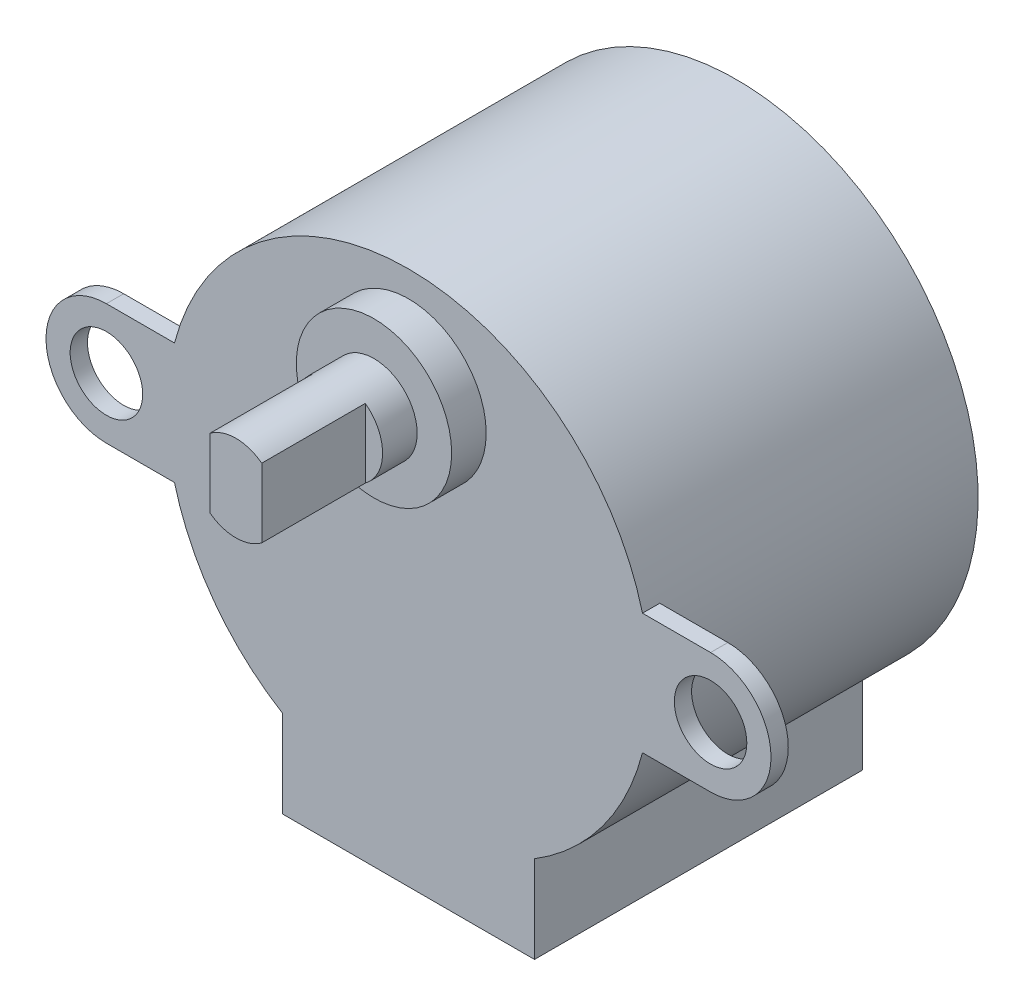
ISO-10303-21;
HEADER;
FILE_DESCRIPTION(('STEP AP214'),'2;1');
FILE_NAME('part.step','',(''),(''),'','','');
FILE_SCHEMA(('AUTOMOTIVE_DESIGN { 1 0 10303 214 1 1 1 1 }'));
ENDSEC;
DATA;
#1=APPLICATION_CONTEXT('core data for automotive mechanical design processes');
#2=APPLICATION_PROTOCOL_DEFINITION('international standard','automotive_design',2000,#1);
#3=PRODUCT_CONTEXT('',#1,'mechanical');
#4=PRODUCT('Part','Part','',(#3));
#5=PRODUCT_RELATED_PRODUCT_CATEGORY('part','',(#4));
#6=PRODUCT_DEFINITION_FORMATION('','',#4);
#7=PRODUCT_DEFINITION_CONTEXT('part definition',#1,'design');
#8=PRODUCT_DEFINITION('design','',#6,#7);
#9=PRODUCT_DEFINITION_SHAPE('','',#8);
#10=(LENGTH_UNIT() NAMED_UNIT(*) SI_UNIT(.MILLI.,.METRE.));
#11=(NAMED_UNIT(*) PLANE_ANGLE_UNIT() SI_UNIT($,.RADIAN.));
#12=(NAMED_UNIT(*) SI_UNIT($,.STERADIAN.) SOLID_ANGLE_UNIT());
#13=UNCERTAINTY_MEASURE_WITH_UNIT(LENGTH_MEASURE(1.E-05),#10,'distance_accuracy_value','');
#14=(GEOMETRIC_REPRESENTATION_CONTEXT(3) GLOBAL_UNCERTAINTY_ASSIGNED_CONTEXT((#13)) GLOBAL_UNIT_ASSIGNED_CONTEXT((#10,
#11,#12)) REPRESENTATION_CONTEXT('',''));
#15=CARTESIAN_POINT('',(0.,0.,0.));
#16=DIRECTION('',(0.,0.,1.));
#17=DIRECTION('',(1.,0.,0.));
#18=AXIS2_PLACEMENT_3D('',#15,#16,#17);
#19=CARTESIAN_POINT('',(0.,8.,5.));
#20=DIRECTION('',(0.,0.,1.));
#21=DIRECTION('',(1.,0.,0.));
#22=AXIS2_PLACEMENT_3D('',#19,#20,#21);
#23=PLANE('',#22);
#24=CARTESIAN_POINT('',(0.,8.,5.));
#25=DIRECTION('',(0.,0.,1.));
#26=DIRECTION('',(1.,0.,0.));
#27=AXIS2_PLACEMENT_3D('',#24,#25,#26);
#28=CIRCLE('',#27,2.5);
#29=CARTESIAN_POINT('',(1.5,6.,5.));
#30=VERTEX_POINT('',#29);
#31=CARTESIAN_POINT('',(1.5,10.,5.));
#32=VERTEX_POINT('',#31);
#33=EDGE_CURVE('E155',#30,#32,#28,.T.);
#34=ORIENTED_EDGE('',*,*,#33,.T.);
#35=DIRECTION('',(0.,-1.,0.));
#36=VECTOR('',#35,1.);
#37=CARTESIAN_POINT('',(1.5,0.,5.));
#38=LINE('',#37,#36);
#39=EDGE_CURVE('E49',#32,#30,#38,.T.);
#40=ORIENTED_EDGE('',*,*,#39,.T.);
#41=EDGE_LOOP('',(#34,#40));
#42=FACE_BOUND('',#41,.T.);
#43=ADVANCED_FACE('F34',(#42),#23,.T.);
#44=CARTESIAN_POINT('',(-17.5,0.,0.));
#45=DIRECTION('',(0.,0.,1.));
#46=DIRECTION('',(1.,0.,0.));
#47=AXIS2_PLACEMENT_3D('',#44,#45,#46);
#48=PLANE('',#47);
#49=CARTESIAN_POINT('',(-17.5,0.,0.));
#50=DIRECTION('',(0.,0.,1.));
#51=DIRECTION('',(1.,0.,0.));
#52=AXIS2_PLACEMENT_3D('',#49,#50,#51);
#53=CIRCLE('',#52,2.1);
#54=CARTESIAN_POINT('',(-15.4,0.,0.));
#55=VERTEX_POINT('',#54);
#56=EDGE_CURVE('E209',#55,#55,#53,.T.);
#57=ORIENTED_EDGE('',*,*,#56,.T.);
#58=EDGE_LOOP('',(#57));
#59=FACE_BOUND('',#58,.T.);
#60=DIRECTION('',(-1.,0.,0.));
#61=VECTOR('',#60,1.);
#62=CARTESIAN_POINT('',(-17.5,3.5,0.));
#63=LINE('',#62,#61);
#64=CARTESIAN_POINT('',(-13.555441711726,3.5,0.));
#65=VERTEX_POINT('',#64);
#66=CARTESIAN_POINT('',(-17.5,3.5,0.));
#67=VERTEX_POINT('',#66);
#68=EDGE_CURVE('E222',#65,#67,#63,.T.);
#69=ORIENTED_EDGE('',*,*,#68,.F.);
#70=CARTESIAN_POINT('',(0.,0.,0.));
#71=DIRECTION('',(0.,0.,1.));
#72=DIRECTION('',(1.,0.,0.));
#73=AXIS2_PLACEMENT_3D('',#70,#71,#72);
#74=CIRCLE('',#73,14.);
#75=CARTESIAN_POINT('',(-13.555441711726,-3.50000000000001,0.));
#76=VERTEX_POINT('',#75);
#77=EDGE_CURVE('E202',#65,#76,#74,.T.);
#78=ORIENTED_EDGE('',*,*,#77,.T.);
#79=DIRECTION('',(1.,0.,0.));
#80=VECTOR('',#79,1.);
#81=CARTESIAN_POINT('',(-17.5,-3.5,0.));
#82=LINE('',#81,#80);
#83=CARTESIAN_POINT('',(-17.5,-3.5,0.));
#84=VERTEX_POINT('',#83);
#85=EDGE_CURVE('E247',#84,#76,#82,.T.);
#86=ORIENTED_EDGE('',*,*,#85,.F.);
#87=CARTESIAN_POINT('',(-17.5,0.,0.));
#88=DIRECTION('',(0.,0.,1.));
#89=DIRECTION('',(1.,0.,0.));
#90=AXIS2_PLACEMENT_3D('',#87,#88,#89);
#91=CIRCLE('',#90,3.5);
#92=EDGE_CURVE('E215',#67,#84,#91,.T.);
#93=ORIENTED_EDGE('',*,*,#92,.F.);
#94=EDGE_LOOP('',(#69,#78,#86,#93));
#95=FACE_BOUND('',#94,.T.);
#96=ADVANCED_FACE('F297',(#59,#95),#48,.F.);
#97=CARTESIAN_POINT('',(-17.5,0.,1.));
#98=DIRECTION('',(0.,0.,1.));
#99=DIRECTION('',(1.,0.,0.));
#100=AXIS2_PLACEMENT_3D('',#97,#98,#99);
#101=PLANE('',#100);
#102=CARTESIAN_POINT('',(0.,8.,1.));
#103=DIRECTION('',(0.,0.,1.));
#104=DIRECTION('',(1.,0.,0.));
#105=AXIS2_PLACEMENT_3D('',#102,#103,#104);
#106=CIRCLE('',#105,4.5);
#107=CARTESIAN_POINT('',(4.5,8.,1.));
#108=VERTEX_POINT('',#107);
#109=EDGE_CURVE('E188',#108,#108,#106,.T.);
#110=ORIENTED_EDGE('',*,*,#109,.F.);
#111=EDGE_LOOP('',(#110));
#112=FACE_BOUND('',#111,.T.);
#113=DIRECTION('',(-1.,0.,0.));
#114=VECTOR('',#113,1.);
#115=CARTESIAN_POINT('',(17.5,3.5,1.));
#116=LINE('',#115,#114);
#117=CARTESIAN_POINT('',(17.5,3.5,1.));
#118=VERTEX_POINT('',#117);
#119=CARTESIAN_POINT('',(13.555441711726,3.5,1.));
#120=VERTEX_POINT('',#119);
#121=EDGE_CURVE('E238',#118,#120,#116,.T.);
#122=ORIENTED_EDGE('',*,*,#121,.T.);
#123=CARTESIAN_POINT('',(0.,0.,1.));
#124=DIRECTION('',(0.,0.,1.));
#125=DIRECTION('',(-1.,0.,0.));
#126=AXIS2_PLACEMENT_3D('',#123,#124,#125);
#127=CIRCLE('',#126,14.);
#128=CARTESIAN_POINT('',(-13.555441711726,3.5,1.));
#129=VERTEX_POINT('',#128);
#130=EDGE_CURVE('E240',#120,#129,#127,.T.);
#131=ORIENTED_EDGE('',*,*,#130,.T.);
#132=DIRECTION('',(-1.,0.,0.));
#133=VECTOR('',#132,1.);
#134=CARTESIAN_POINT('',(-17.5,3.5,1.));
#135=LINE('',#134,#133);
#136=CARTESIAN_POINT('',(-17.5,3.5,1.));
#137=VERTEX_POINT('',#136);
#138=EDGE_CURVE('E242',#129,#137,#135,.T.);
#139=ORIENTED_EDGE('',*,*,#138,.T.);
#140=CARTESIAN_POINT('',(-17.5,0.,1.));
#141=DIRECTION('',(0.,0.,1.));
#142=DIRECTION('',(1.,0.,0.));
#143=AXIS2_PLACEMENT_3D('',#140,#141,#142);
#144=CIRCLE('',#143,3.5);
#145=CARTESIAN_POINT('',(-17.5,-3.5,1.));
#146=VERTEX_POINT('',#145);
#147=EDGE_CURVE('E218',#137,#146,#144,.T.);
#148=ORIENTED_EDGE('',*,*,#147,.T.);
#149=DIRECTION('',(1.,0.,0.));
#150=VECTOR('',#149,1.);
#151=CARTESIAN_POINT('',(-17.5,-3.5,1.));
#152=LINE('',#151,#150);
#153=CARTESIAN_POINT('',(-13.555441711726,-3.50000000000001,1.));
#154=VERTEX_POINT('',#153);
#155=EDGE_CURVE('E221',#146,#154,#152,.T.);
#156=ORIENTED_EDGE('',*,*,#155,.T.);
#157=CARTESIAN_POINT('',(0.,0.,1.));
#158=DIRECTION('',(0.,0.,1.));
#159=DIRECTION('',(-1.,0.,0.));
#160=AXIS2_PLACEMENT_3D('',#157,#158,#159);
#161=CIRCLE('',#160,14.);
#162=CARTESIAN_POINT('',(-7.3,-11.9461290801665,1.));
#163=VERTEX_POINT('',#162);
#164=EDGE_CURVE('E224',#154,#163,#161,.T.);
#165=ORIENTED_EDGE('',*,*,#164,.T.);
#166=DIRECTION('',(0.,-1.,0.));
#167=VECTOR('',#166,1.);
#168=CARTESIAN_POINT('',(-7.3,-17.,1.));
#169=LINE('',#168,#167);
#170=CARTESIAN_POINT('',(-7.3,-17.,1.));
#171=VERTEX_POINT('',#170);
#172=EDGE_CURVE('E226',#163,#171,#169,.T.);
#173=ORIENTED_EDGE('',*,*,#172,.T.);
#174=DIRECTION('',(1.,0.,0.));
#175=VECTOR('',#174,1.);
#176=CARTESIAN_POINT('',(-7.3,-17.,1.));
#177=LINE('',#176,#175);
#178=CARTESIAN_POINT('',(7.3,-17.,1.));
#179=VERTEX_POINT('',#178);
#180=EDGE_CURVE('E228',#171,#179,#177,.T.);
#181=ORIENTED_EDGE('',*,*,#180,.T.);
#182=DIRECTION('',(0.,1.,0.));
#183=VECTOR('',#182,1.);
#184=CARTESIAN_POINT('',(7.3,-17.,1.));
#185=LINE('',#184,#183);
#186=CARTESIAN_POINT('',(7.3,-11.9461290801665,1.));
#187=VERTEX_POINT('',#186);
#188=EDGE_CURVE('E230',#179,#187,#185,.T.);
#189=ORIENTED_EDGE('',*,*,#188,.T.);
#190=CARTESIAN_POINT('',(0.,0.,1.));
#191=DIRECTION('',(0.,0.,1.));
#192=DIRECTION('',(-1.,0.,0.));
#193=AXIS2_PLACEMENT_3D('',#190,#191,#192);
#194=CIRCLE('',#193,14.);
#195=CARTESIAN_POINT('',(13.555441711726,-3.5,1.));
#196=VERTEX_POINT('',#195);
#197=EDGE_CURVE('E232',#187,#196,#194,.T.);
#198=ORIENTED_EDGE('',*,*,#197,.T.);
#199=DIRECTION('',(1.,0.,0.));
#200=VECTOR('',#199,1.);
#201=CARTESIAN_POINT('',(13.555441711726,-3.5,1.));
#202=LINE('',#201,#200);
#203=CARTESIAN_POINT('',(17.5,-3.5,1.));
#204=VERTEX_POINT('',#203);
#205=EDGE_CURVE('E234',#196,#204,#202,.T.);
#206=ORIENTED_EDGE('',*,*,#205,.T.);
#207=CARTESIAN_POINT('',(17.5,0.,1.));
#208=DIRECTION('',(0.,0.,1.));
#209=DIRECTION('',(-1.,0.,0.));
#210=AXIS2_PLACEMENT_3D('',#207,#208,#209);
#211=CIRCLE('',#210,3.5);
#212=EDGE_CURVE('E236',#204,#118,#211,.T.);
#213=ORIENTED_EDGE('',*,*,#212,.T.);
#214=EDGE_LOOP('',(#122,#131,#139,#148,#156,#165,#173,#181,#189,#198,#206,#213));
#215=FACE_BOUND('',#214,.T.);
#216=CARTESIAN_POINT('',(17.5,0.,1.));
#217=DIRECTION('',(0.,0.,1.));
#218=DIRECTION('',(1.,0.,0.));
#219=AXIS2_PLACEMENT_3D('',#216,#217,#218);
#220=CIRCLE('',#219,2.1);
#221=CARTESIAN_POINT('',(19.6,0.,1.));
#222=VERTEX_POINT('',#221);
#223=EDGE_CURVE('E212',#222,#222,#220,.T.);
#224=ORIENTED_EDGE('',*,*,#223,.F.);
#225=EDGE_LOOP('',(#224));
#226=FACE_BOUND('',#225,.T.);
#227=CARTESIAN_POINT('',(-17.5,0.,1.));
#228=DIRECTION('',(0.,0.,1.));
#229=DIRECTION('',(1.,0.,0.));
#230=AXIS2_PLACEMENT_3D('',#227,#228,#229);
#231=CIRCLE('',#230,2.1);
#232=CARTESIAN_POINT('',(-15.4,0.,1.));
#233=VERTEX_POINT('',#232);
#234=EDGE_CURVE('E205',#233,#233,#231,.T.);
#235=ORIENTED_EDGE('',*,*,#234,.F.);
#236=EDGE_LOOP('',(#235));
#237=FACE_BOUND('',#236,.T.);
#238=ADVANCED_FACE('F305',(#112,#215,#226,#237),#101,.T.);
#239=DIRECTION('',(1.,0.,0.));
#240=VECTOR('',#239,1.);
#241=CARTESIAN_POINT('',(13.555441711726,-3.5,0.));
#242=LINE('',#241,#240);
#243=CARTESIAN_POINT('',(13.555441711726,-3.5,0.));
#244=VERTEX_POINT('',#243);
#245=CARTESIAN_POINT('',(17.5,-3.5,0.));
#246=VERTEX_POINT('',#245);
#247=EDGE_CURVE('E250',#244,#246,#242,.T.);
#248=ORIENTED_EDGE('',*,*,#247,.F.);
#249=CARTESIAN_POINT('',(13.555441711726,3.5,0.));
#250=VERTEX_POINT('',#249);
#251=EDGE_CURVE('E204',#244,#250,#74,.T.);
#252=ORIENTED_EDGE('',*,*,#251,.T.);
#253=DIRECTION('',(-1.,0.,0.));
#254=VECTOR('',#253,1.);
#255=CARTESIAN_POINT('',(17.5,3.5,0.));
#256=LINE('',#255,#254);
#257=CARTESIAN_POINT('',(17.5,3.5,0.));
#258=VERTEX_POINT('',#257);
#259=EDGE_CURVE('E254',#258,#250,#256,.T.);
#260=ORIENTED_EDGE('',*,*,#259,.F.);
#261=CARTESIAN_POINT('',(17.5,0.,0.));
#262=DIRECTION('',(0.,0.,1.));
#263=DIRECTION('',(-1.,0.,0.));
#264=AXIS2_PLACEMENT_3D('',#261,#262,#263);
#265=CIRCLE('',#264,3.5);
#266=EDGE_CURVE('E252',#246,#258,#265,.T.);
#267=ORIENTED_EDGE('',*,*,#266,.F.);
#268=EDGE_LOOP('',(#248,#252,#260,#267));
#269=FACE_BOUND('',#268,.T.);
#270=CARTESIAN_POINT('',(17.5,0.,0.));
#271=DIRECTION('',(0.,0.,1.));
#272=DIRECTION('',(1.,0.,0.));
#273=AXIS2_PLACEMENT_3D('',#270,#271,#272);
#274=CIRCLE('',#273,2.1);
#275=CARTESIAN_POINT('',(19.6,0.,0.));
#276=VERTEX_POINT('',#275);
#277=EDGE_CURVE('E208',#276,#276,#274,.T.);
#278=ORIENTED_EDGE('',*,*,#277,.T.);
#279=EDGE_LOOP('',(#278));
#280=FACE_BOUND('',#279,.T.);
#281=ADVANCED_FACE('F317',(#269,#280),#48,.F.);
#282=CARTESIAN_POINT('',(-17.5,0.,1.));
#283=DIRECTION('',(0.,0.,-1.));
#284=DIRECTION('',(-1.,0.,0.));
#285=AXIS2_PLACEMENT_3D('',#282,#283,#284);
#286=CYLINDRICAL_SURFACE('',#285,3.5);
#287=ORIENTED_EDGE('',*,*,#92,.T.);
#288=DIRECTION('',(0.,0.,-1.));
#289=VECTOR('',#288,1.);
#290=CARTESIAN_POINT('',(-17.5,-3.5,1.));
#291=LINE('',#290,#289);
#292=EDGE_CURVE('E38',#146,#84,#291,.T.);
#293=ORIENTED_EDGE('',*,*,#292,.F.);
#294=ORIENTED_EDGE('',*,*,#147,.F.);
#295=DIRECTION('',(0.,0.,-1.));
#296=VECTOR('',#295,1.);
#297=CARTESIAN_POINT('',(-17.5,3.5,1.));
#298=LINE('',#297,#296);
#299=EDGE_CURVE('E244',#137,#67,#298,.T.);
#300=ORIENTED_EDGE('',*,*,#299,.T.);
#301=EDGE_LOOP('',(#287,#293,#294,#300));
#302=FACE_BOUND('',#301,.T.);
#303=ADVANCED_FACE('F36',(#302),#286,.T.);
#304=CARTESIAN_POINT('',(-17.5,-3.5,1.));
#305=DIRECTION('',(0.,1.,0.));
#306=DIRECTION('',(0.,0.,1.));
#307=AXIS2_PLACEMENT_3D('',#304,#305,#306);
#308=PLANE('',#307);
#309=ORIENTED_EDGE('',*,*,#85,.T.);
#310=DIRECTION('',(0.,0.,-1.));
#311=VECTOR('',#310,1.);
#312=CARTESIAN_POINT('',(-13.555441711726,-3.50000000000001,1.));
#313=LINE('',#312,#311);
#314=EDGE_CURVE('E282',#154,#76,#313,.T.);
#315=ORIENTED_EDGE('',*,*,#314,.F.);
#316=ORIENTED_EDGE('',*,*,#155,.F.);
#317=ORIENTED_EDGE('',*,*,#292,.T.);
#318=EDGE_LOOP('',(#309,#315,#316,#317));
#319=FACE_BOUND('',#318,.T.);
#320=ADVANCED_FACE('F290',(#319),#308,.F.);
#321=CARTESIAN_POINT('',(-7.3,-17.,1.));
#322=DIRECTION('',(1.,0.,0.));
#323=DIRECTION('',(0.,1.,0.));
#324=AXIS2_PLACEMENT_3D('',#321,#322,#323);
#325=PLANE('',#324);
#326=DIRECTION('',(0.,0.,-1.));
#327=VECTOR('',#326,1.);
#328=CARTESIAN_POINT('',(-7.3,-11.9461290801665,1.));
#329=LINE('',#328,#327);
#330=CARTESIAN_POINT('',(-7.3,-11.9461290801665,-18.));
#331=VERTEX_POINT('',#330);
#332=EDGE_CURVE('E281',#163,#331,#329,.T.);
#333=ORIENTED_EDGE('',*,*,#332,.T.);
#334=DIRECTION('',(0.,-1.,0.));
#335=VECTOR('',#334,1.);
#336=CARTESIAN_POINT('',(-7.3,-11.9461290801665,-18.));
#337=LINE('',#336,#335);
#338=CARTESIAN_POINT('',(-7.3,-17.,-18.));
#339=VERTEX_POINT('',#338);
#340=EDGE_CURVE('E193',#331,#339,#337,.T.);
#341=ORIENTED_EDGE('',*,*,#340,.T.);
#342=DIRECTION('',(0.,0.,-1.));
#343=VECTOR('',#342,1.);
#344=CARTESIAN_POINT('',(-7.3,-17.,1.));
#345=LINE('',#344,#343);
#346=EDGE_CURVE('E279',#171,#339,#345,.T.);
#347=ORIENTED_EDGE('',*,*,#346,.F.);
#348=ORIENTED_EDGE('',*,*,#172,.F.);
#349=EDGE_LOOP('',(#333,#341,#347,#348));
#350=FACE_BOUND('',#349,.T.);
#351=ADVANCED_FACE('F344',(#350),#325,.F.);
#352=CARTESIAN_POINT('',(-7.3,-17.,1.));
#353=DIRECTION('',(0.,1.,0.));
#354=DIRECTION('',(-1.,0.,0.));
#355=AXIS2_PLACEMENT_3D('',#352,#353,#354);
#356=PLANE('',#355);
#357=ORIENTED_EDGE('',*,*,#346,.T.);
#358=DIRECTION('',(1.,0.,0.));
#359=VECTOR('',#358,1.);
#360=CARTESIAN_POINT('',(-7.3,-17.,-18.));
#361=LINE('',#360,#359);
#362=CARTESIAN_POINT('',(7.3,-17.,-18.));
#363=VERTEX_POINT('',#362);
#364=EDGE_CURVE('E196',#339,#363,#361,.T.);
#365=ORIENTED_EDGE('',*,*,#364,.T.);
#366=DIRECTION('',(0.,0.,-1.));
#367=VECTOR('',#366,1.);
#368=CARTESIAN_POINT('',(7.3,-17.,1.));
#369=LINE('',#368,#367);
#370=EDGE_CURVE('E277',#179,#363,#369,.T.);
#371=ORIENTED_EDGE('',*,*,#370,.F.);
#372=ORIENTED_EDGE('',*,*,#180,.F.);
#373=EDGE_LOOP('',(#357,#365,#371,#372));
#374=FACE_BOUND('',#373,.T.);
#375=ADVANCED_FACE('F341',(#374),#356,.F.);
#376=CARTESIAN_POINT('',(7.3,-17.,1.));
#377=DIRECTION('',(-1.,0.,0.));
#378=DIRECTION('',(0.,0.,1.));
#379=AXIS2_PLACEMENT_3D('',#376,#377,#378);
#380=PLANE('',#379);
#381=ORIENTED_EDGE('',*,*,#370,.T.);
#382=DIRECTION('',(0.,1.,0.));
#383=VECTOR('',#382,1.);
#384=CARTESIAN_POINT('',(7.3,-17.,-18.));
#385=LINE('',#384,#383);
#386=CARTESIAN_POINT('',(7.3,-11.9461290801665,-18.));
#387=VERTEX_POINT('',#386);
#388=EDGE_CURVE('E199',#363,#387,#385,.T.);
#389=ORIENTED_EDGE('',*,*,#388,.T.);
#390=DIRECTION('',(0.,0.,-1.));
#391=VECTOR('',#390,1.);
#392=CARTESIAN_POINT('',(7.3,-11.9461290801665,1.));
#393=LINE('',#392,#391);
#394=EDGE_CURVE('E275',#187,#387,#393,.T.);
#395=ORIENTED_EDGE('',*,*,#394,.F.);
#396=ORIENTED_EDGE('',*,*,#188,.F.);
#397=EDGE_LOOP('',(#381,#389,#395,#396));
#398=FACE_BOUND('',#397,.T.);
#399=ADVANCED_FACE('F337',(#398),#380,.F.);
#400=CARTESIAN_POINT('',(13.555441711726,-3.5,1.));
#401=DIRECTION('',(0.,1.,0.));
#402=DIRECTION('',(0.,0.,1.));
#403=AXIS2_PLACEMENT_3D('',#400,#401,#402);
#404=PLANE('',#403);
#405=ORIENTED_EDGE('',*,*,#247,.T.);
#406=DIRECTION('',(0.,0.,-1.));
#407=VECTOR('',#406,1.);
#408=CARTESIAN_POINT('',(17.5,-3.5,1.));
#409=LINE('',#408,#407);
#410=EDGE_CURVE('E269',#204,#246,#409,.T.);
#411=ORIENTED_EDGE('',*,*,#410,.F.);
#412=ORIENTED_EDGE('',*,*,#205,.F.);
#413=DIRECTION('',(0.,0.,-1.));
#414=VECTOR('',#413,1.);
#415=CARTESIAN_POINT('',(13.555441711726,-3.5,1.));
#416=LINE('',#415,#414);
#417=EDGE_CURVE('E272',#196,#244,#416,.T.);
#418=ORIENTED_EDGE('',*,*,#417,.T.);
#419=EDGE_LOOP('',(#405,#411,#412,#418));
#420=FACE_BOUND('',#419,.T.);
#421=ADVANCED_FACE('F321',(#420),#404,.F.);
#422=CARTESIAN_POINT('',(17.5,0.,1.));
#423=DIRECTION('',(0.,0.,-1.));
#424=DIRECTION('',(-1.,0.,0.));
#425=AXIS2_PLACEMENT_3D('',#422,#423,#424);
#426=CYLINDRICAL_SURFACE('',#425,3.5);
#427=ORIENTED_EDGE('',*,*,#266,.T.);
#428=DIRECTION('',(0.,0.,-1.));
#429=VECTOR('',#428,1.);
#430=CARTESIAN_POINT('',(17.5,3.5,1.));
#431=LINE('',#430,#429);
#432=EDGE_CURVE('E266',#118,#258,#431,.T.);
#433=ORIENTED_EDGE('',*,*,#432,.F.);
#434=ORIENTED_EDGE('',*,*,#212,.F.);
#435=ORIENTED_EDGE('',*,*,#410,.T.);
#436=EDGE_LOOP('',(#427,#433,#434,#435));
#437=FACE_BOUND('',#436,.T.);
#438=ADVANCED_FACE('F325',(#437),#426,.T.);
#439=CARTESIAN_POINT('',(17.5,3.5,1.));
#440=DIRECTION('',(0.,-1.,0.));
#441=DIRECTION('',(0.,0.,-1.));
#442=AXIS2_PLACEMENT_3D('',#439,#440,#441);
#443=PLANE('',#442);
#444=ORIENTED_EDGE('',*,*,#259,.T.);
#445=DIRECTION('',(0.,0.,-1.));
#446=VECTOR('',#445,1.);
#447=CARTESIAN_POINT('',(13.555441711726,3.5,1.));
#448=LINE('',#447,#446);
#449=EDGE_CURVE('E263',#120,#250,#448,.T.);
#450=ORIENTED_EDGE('',*,*,#449,.F.);
#451=ORIENTED_EDGE('',*,*,#121,.F.);
#452=ORIENTED_EDGE('',*,*,#432,.T.);
#453=EDGE_LOOP('',(#444,#450,#451,#452));
#454=FACE_BOUND('',#453,.T.);
#455=ADVANCED_FACE('F311',(#454),#443,.F.);
#456=CARTESIAN_POINT('',(0.,0.,1.));
#457=DIRECTION('',(0.,0.,-1.));
#458=DIRECTION('',(-1.,0.,0.));
#459=AXIS2_PLACEMENT_3D('',#456,#457,#458);
#460=CYLINDRICAL_SURFACE('',#459,14.);
#461=ORIENTED_EDGE('',*,*,#449,.T.);
#462=ORIENTED_EDGE('',*,*,#251,.F.);
#463=ORIENTED_EDGE('',*,*,#417,.F.);
#464=ORIENTED_EDGE('',*,*,#197,.F.);
#465=ORIENTED_EDGE('',*,*,#394,.T.);
#466=CARTESIAN_POINT('',(0.,0.,-18.));
#467=DIRECTION('',(0.,0.,1.));
#468=DIRECTION('',(1.,0.,0.));
#469=AXIS2_PLACEMENT_3D('',#466,#467,#468);
#470=CIRCLE('',#469,14.);
#471=EDGE_CURVE('E187',#387,#331,#470,.T.);
#472=ORIENTED_EDGE('',*,*,#471,.T.);
#473=ORIENTED_EDGE('',*,*,#332,.F.);
#474=ORIENTED_EDGE('',*,*,#164,.F.);
#475=ORIENTED_EDGE('',*,*,#314,.T.);
#476=ORIENTED_EDGE('',*,*,#77,.F.);
#477=DIRECTION('',(0.,0.,-1.));
#478=VECTOR('',#477,1.);
#479=CARTESIAN_POINT('',(-13.555441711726,3.5,1.));
#480=LINE('',#479,#478);
#481=EDGE_CURVE('E260',#129,#65,#480,.T.);
#482=ORIENTED_EDGE('',*,*,#481,.F.);
#483=ORIENTED_EDGE('',*,*,#130,.F.);
#484=EDGE_LOOP('',(#461,#462,#463,#464,#465,#472,#473,#474,#475,#476,#482,#483));
#485=FACE_BOUND('',#484,.T.);
#486=ADVANCED_FACE('F299',(#485),#460,.T.);
#487=CARTESIAN_POINT('',(-17.5,3.5,1.));
#488=DIRECTION('',(0.,-1.,0.));
#489=DIRECTION('',(0.,0.,-1.));
#490=AXIS2_PLACEMENT_3D('',#487,#488,#489);
#491=PLANE('',#490);
#492=ORIENTED_EDGE('',*,*,#68,.T.);
#493=ORIENTED_EDGE('',*,*,#299,.F.);
#494=ORIENTED_EDGE('',*,*,#138,.F.);
#495=ORIENTED_EDGE('',*,*,#481,.T.);
#496=EDGE_LOOP('',(#492,#493,#494,#495));
#497=FACE_BOUND('',#496,.T.);
#498=ADVANCED_FACE('F303',(#497),#491,.F.);
#499=CARTESIAN_POINT('',(17.5,0.,1.));
#500=DIRECTION('',(0.,0.,-1.));
#501=DIRECTION('',(-1.,0.,0.));
#502=AXIS2_PLACEMENT_3D('',#499,#500,#501);
#503=CYLINDRICAL_SURFACE('',#502,2.1);
#504=ORIENTED_EDGE('',*,*,#223,.T.);
#505=EDGE_LOOP('',(#504));
#506=FACE_BOUND('',#505,.T.);
#507=ORIENTED_EDGE('',*,*,#277,.F.);
#508=EDGE_LOOP('',(#507));
#509=FACE_BOUND('',#508,.T.);
#510=ADVANCED_FACE('F385',(#506,#509),#503,.F.);
#511=CARTESIAN_POINT('',(-17.5,0.,1.));
#512=DIRECTION('',(0.,0.,-1.));
#513=DIRECTION('',(-1.,0.,0.));
#514=AXIS2_PLACEMENT_3D('',#511,#512,#513);
#515=CYLINDRICAL_SURFACE('',#514,2.1);
#516=ORIENTED_EDGE('',*,*,#234,.T.);
#517=EDGE_LOOP('',(#516));
#518=FACE_BOUND('',#517,.T.);
#519=ORIENTED_EDGE('',*,*,#56,.F.);
#520=EDGE_LOOP('',(#519));
#521=FACE_BOUND('',#520,.T.);
#522=ADVANCED_FACE('F382',(#518,#521),#515,.F.);
#523=CARTESIAN_POINT('',(0.,0.,-18.));
#524=DIRECTION('',(0.,0.,1.));
#525=DIRECTION('',(1.,0.,0.));
#526=AXIS2_PLACEMENT_3D('',#523,#524,#525);
#527=PLANE('',#526);
#528=ORIENTED_EDGE('',*,*,#471,.F.);
#529=ORIENTED_EDGE('',*,*,#388,.F.);
#530=ORIENTED_EDGE('',*,*,#364,.F.);
#531=ORIENTED_EDGE('',*,*,#340,.F.);
#532=EDGE_LOOP('',(#528,#529,#530,#531));
#533=FACE_BOUND('',#532,.T.);
#534=ADVANCED_FACE('F335',(#533),#527,.F.);
#535=CARTESIAN_POINT('',(0.,8.,3.));
#536=DIRECTION('',(0.,0.,-1.));
#537=DIRECTION('',(-1.,0.,0.));
#538=AXIS2_PLACEMENT_3D('',#535,#536,#537);
#539=CYLINDRICAL_SURFACE('',#538,4.5);
#540=CARTESIAN_POINT('',(0.,8.,3.));
#541=DIRECTION('',(0.,0.,1.));
#542=DIRECTION('',(1.,0.,0.));
#543=AXIS2_PLACEMENT_3D('',#540,#541,#542);
#544=CIRCLE('',#543,4.5);
#545=CARTESIAN_POINT('',(4.5,8.,3.));
#546=VERTEX_POINT('',#545);
#547=EDGE_CURVE('E184',#546,#546,#544,.T.);
#548=ORIENTED_EDGE('',*,*,#547,.F.);
#549=EDGE_LOOP('',(#548));
#550=FACE_BOUND('',#549,.T.);
#551=ORIENTED_EDGE('',*,*,#109,.T.);
#552=EDGE_LOOP('',(#551));
#553=FACE_BOUND('',#552,.T.);
#554=ADVANCED_FACE('F373',(#550,#553),#539,.T.);
#555=CARTESIAN_POINT('',(0.,8.,3.));
#556=DIRECTION('',(0.,0.,1.));
#557=DIRECTION('',(1.,0.,0.));
#558=AXIS2_PLACEMENT_3D('',#555,#556,#557);
#559=PLANE('',#558);
#560=CARTESIAN_POINT('',(0.,8.,3.));
#561=DIRECTION('',(0.,0.,1.));
#562=DIRECTION('',(1.,0.,0.));
#563=AXIS2_PLACEMENT_3D('',#560,#561,#562);
#564=CIRCLE('',#563,2.5);
#565=CARTESIAN_POINT('',(2.5,8.,3.));
#566=VERTEX_POINT('',#565);
#567=EDGE_CURVE('E11',#566,#566,#564,.T.);
#568=ORIENTED_EDGE('',*,*,#567,.F.);
#569=EDGE_LOOP('',(#568));
#570=FACE_BOUND('',#569,.T.);
#571=ORIENTED_EDGE('',*,*,#547,.T.);
#572=EDGE_LOOP('',(#571));
#573=FACE_BOUND('',#572,.T.);
#574=ADVANCED_FACE('F369',(#570,#573),#559,.T.);
#575=CARTESIAN_POINT('',(0.,8.,5.));
#576=DIRECTION('',(0.,0.,-1.));
#577=DIRECTION('',(-1.,0.,0.));
#578=AXIS2_PLACEMENT_3D('',#575,#576,#577);
#579=CYLINDRICAL_SURFACE('',#578,2.5);
#580=CARTESIAN_POINT('',(-1.5,10.,5.));
#581=VERTEX_POINT('',#580);
#582=CARTESIAN_POINT('',(-1.5,6.,5.));
#583=VERTEX_POINT('',#582);
#584=EDGE_CURVE('E182',#581,#583,#28,.T.);
#585=ORIENTED_EDGE('',*,*,#584,.F.);
#586=DIRECTION('',(0.,0.,-1.));
#587=VECTOR('',#586,1.);
#588=CARTESIAN_POINT('',(-1.5,10.,11.));
#589=LINE('',#588,#587);
#590=CARTESIAN_POINT('',(-1.5,10.,11.));
#591=VERTEX_POINT('',#590);
#592=EDGE_CURVE('E156',#591,#581,#589,.T.);
#593=ORIENTED_EDGE('',*,*,#592,.F.);
#594=CARTESIAN_POINT('',(0.,8.,11.));
#595=DIRECTION('',(0.,0.,1.));
#596=DIRECTION('',(1.,0.,0.));
#597=AXIS2_PLACEMENT_3D('',#594,#595,#596);
#598=CIRCLE('',#597,2.5);
#599=CARTESIAN_POINT('',(1.5,10.,11.));
#600=VERTEX_POINT('',#599);
#601=EDGE_CURVE('E159',#600,#591,#598,.T.);
#602=ORIENTED_EDGE('',*,*,#601,.F.);
#603=DIRECTION('',(0.,0.,-1.));
#604=VECTOR('',#603,1.);
#605=CARTESIAN_POINT('',(1.5,10.,11.));
#606=LINE('',#605,#604);
#607=EDGE_CURVE('E148',#600,#32,#606,.T.);
#608=ORIENTED_EDGE('',*,*,#607,.T.);
#609=ORIENTED_EDGE('',*,*,#33,.F.);
#610=DIRECTION('',(0.,0.,-1.));
#611=VECTOR('',#610,1.);
#612=CARTESIAN_POINT('',(1.5,6.,11.));
#613=LINE('',#612,#611);
#614=CARTESIAN_POINT('',(1.5,6.,11.));
#615=VERTEX_POINT('',#614);
#616=EDGE_CURVE('E176',#615,#30,#613,.T.);
#617=ORIENTED_EDGE('',*,*,#616,.F.);
#618=CARTESIAN_POINT('',(-1.5,6.,11.));
#619=VERTEX_POINT('',#618);
#620=EDGE_CURVE('E167',#619,#615,#598,.T.);
#621=ORIENTED_EDGE('',*,*,#620,.F.);
#622=DIRECTION('',(0.,0.,-1.));
#623=VECTOR('',#622,1.);
#624=CARTESIAN_POINT('',(-1.5,6.,11.));
#625=LINE('',#624,#623);
#626=EDGE_CURVE('E178',#619,#583,#625,.T.);
#627=ORIENTED_EDGE('',*,*,#626,.T.);
#628=EDGE_LOOP('',(#585,#593,#602,#608,#609,#617,#621,#627));
#629=FACE_BOUND('',#628,.T.);
#630=ORIENTED_EDGE('',*,*,#567,.T.);
#631=EDGE_LOOP('',(#630));
#632=FACE_BOUND('',#631,.T.);
#633=ADVANCED_FACE('F160',(#629,#632),#579,.T.);
#634=DIRECTION('',(0.,-1.,0.));
#635=VECTOR('',#634,1.);
#636=CARTESIAN_POINT('',(-1.5,0.,5.));
#637=LINE('',#636,#635);
#638=EDGE_CURVE('E56',#581,#583,#637,.T.);
#639=ORIENTED_EDGE('',*,*,#638,.F.);
#640=ORIENTED_EDGE('',*,*,#584,.T.);
#641=EDGE_LOOP('',(#639,#640));
#642=FACE_BOUND('',#641,.T.);
#643=ADVANCED_FACE('F355',(#642),#23,.T.);
#644=CARTESIAN_POINT('',(1.5,0.,11.));
#645=DIRECTION('',(1.,0.,0.));
#646=DIRECTION('',(0.,1.,0.));
#647=AXIS2_PLACEMENT_3D('',#644,#645,#646);
#648=PLANE('',#647);
#649=ORIENTED_EDGE('',*,*,#39,.F.);
#650=ORIENTED_EDGE('',*,*,#607,.F.);
#651=DIRECTION('',(0.,-1.,0.));
#652=VECTOR('',#651,1.);
#653=CARTESIAN_POINT('',(1.5,0.,11.));
#654=LINE('',#653,#652);
#655=EDGE_CURVE('E153',#600,#615,#654,.T.);
#656=ORIENTED_EDGE('',*,*,#655,.T.);
#657=ORIENTED_EDGE('',*,*,#616,.T.);
#658=EDGE_LOOP('',(#649,#650,#656,#657));
#659=FACE_BOUND('',#658,.T.);
#660=ADVANCED_FACE('F150',(#659),#648,.T.);
#661=CARTESIAN_POINT('',(-1.5,0.,11.));
#662=DIRECTION('',(1.,0.,0.));
#663=DIRECTION('',(0.,1.,0.));
#664=AXIS2_PLACEMENT_3D('',#661,#662,#663);
#665=PLANE('',#664);
#666=ORIENTED_EDGE('',*,*,#638,.T.);
#667=ORIENTED_EDGE('',*,*,#626,.F.);
#668=DIRECTION('',(0.,-1.,0.));
#669=VECTOR('',#668,1.);
#670=CARTESIAN_POINT('',(-1.5,0.,11.));
#671=LINE('',#670,#669);
#672=EDGE_CURVE('E165',#591,#619,#671,.T.);
#673=ORIENTED_EDGE('',*,*,#672,.F.);
#674=ORIENTED_EDGE('',*,*,#592,.T.);
#675=EDGE_LOOP('',(#666,#667,#673,#674));
#676=FACE_BOUND('',#675,.T.);
#677=ADVANCED_FACE('F368',(#676),#665,.F.);
#678=CARTESIAN_POINT('',(0.,0.,11.));
#679=DIRECTION('',(0.,0.,1.));
#680=DIRECTION('',(1.,0.,0.));
#681=AXIS2_PLACEMENT_3D('',#678,#679,#680);
#682=PLANE('',#681);
#683=ORIENTED_EDGE('',*,*,#655,.F.);
#684=ORIENTED_EDGE('',*,*,#601,.T.);
#685=ORIENTED_EDGE('',*,*,#672,.T.);
#686=ORIENTED_EDGE('',*,*,#620,.T.);
#687=EDGE_LOOP('',(#683,#684,#685,#686));
#688=FACE_BOUND('',#687,.T.);
#689=ADVANCED_FACE('F168',(#688),#682,.T.);
#690=CLOSED_SHELL('',(#43,#96,#238,#281,#303,#320,#351,#375,#399,#421,#438,#455,#486,#498,#510,
#522,#534,#554,#574,#633,#643,#660,#677,#689));
#691=MANIFOLD_SOLID_BREP('B2',#690);
#692=ADVANCED_BREP_SHAPE_REPRESENTATION('',(#18,#691),#14);
#693=SHAPE_DEFINITION_REPRESENTATION(#9,#692);
ENDSEC;
END-ISO-10303-21;
